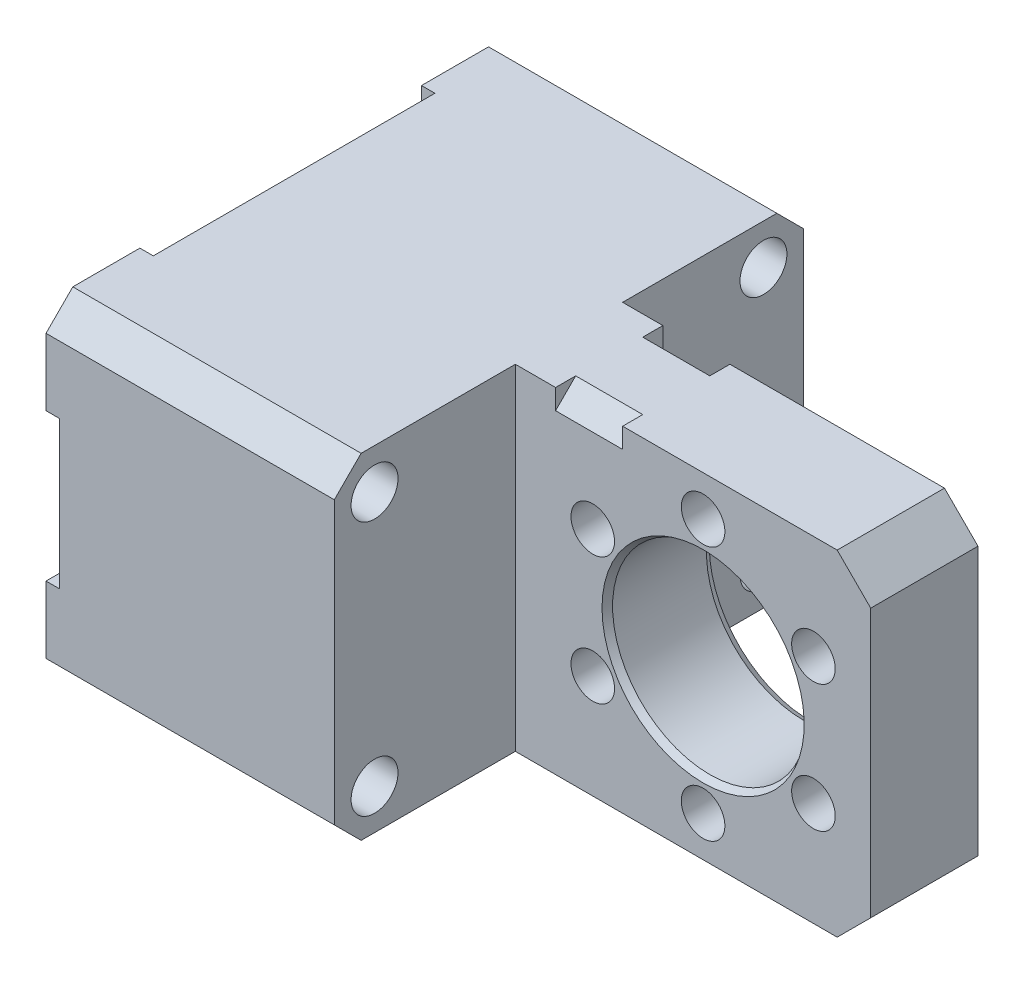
from build123d import *

# Parameters (mm, degrees)
BOSS_EXTRU_1_DEPTH            = 25
DIAM_TRE_DU_PER_AGE_7_0_7_1_D = 7
ESQUISSE4_R                   = 14.5
ENL_V_MAT_EXTRU_1_DEPTH       = 30
ESQUISSE5_R                   = 3.25
ENL_V_MAT_EXTRU_2_DEPTH       = 30
R_P_TITION_CIRCULAIRE1_COUNT  = 6
CHANFREIN1_SIZE               = 4
CHANFREIN2_SIZE               = 5
ESQUISSE6_OUTSIDE_W           = 97.78
ESQUISSE6_OUTSIDE_H           = 77.78
ENL_V_MAT_EXTRU_3_DEPTH       = 2
ENL_V_START                   = 6
ENL_V_MAT_EXTRU_4_DEPTH       = 10
CHANFREIN3_SIZE               = 1
CHANFREIN3_SIZE2              = 0.577350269


with BuildPart() as part:
    # Esquisse1 → Boss.-Extru.1 (new, symmetric)
    with BuildSketch(Plane(origin=(0, 0, 0), x_dir=(1, 0, 0), z_dir=(0, 1, 0))):
        Polygon((0, 0), (43, 0), (43, -27), (96, -27), (96, -43), (43, -43), (43, -70), (0, -70), align=None)
    extrude(amount=BOSS_EXTRU_1_DEPTH, both=True)

    # Diam_tre du per_age _7.0 _7_1 (through all)
    with Locations(Plane(origin=(43, 0, 0), x_dir=(0, 0, -1), z_dir=(1, 0, 0))):
        with Locations((-64, 19), (-6, 19), (-6, -19), (-64, -19)):
            Hole(DIAM_TRE_DU_PER_AGE_7_0_7_1_D / 2)

    # Esquisse4 → Enl_v. mat.-Extru.1 (cut)
    with BuildSketch(Plane(origin=(0, 0, 27), x_dir=(-1, 0, 0), z_dir=(0, 0, -1))):
        with Locations((-71, 0)):
            Circle(ESQUISSE4_R)
    extrude(amount=-ENL_V_MAT_EXTRU_1_DEPTH, mode=Mode.SUBTRACT)

    # Esquisse5 → Enl_v. mat.-Extru.2 (cut)
    with BuildSketch(Plane(origin=(0, 0, 27), x_dir=(-1, 0, 0), z_dir=(0, 0, -1))):
        with Locations((-71, -19)):
            Circle(ESQUISSE5_R)
    enl_v_mat_extru_2 = extrude(amount=-ENL_V_MAT_EXTRU_2_DEPTH, mode=Mode.SUBTRACT)

    # R_p_tition circulaire1: Enl_v. mat.-Extru.2 ×6 about axis
    r_p_tition_circulaire1_axis = Axis((71, 0, 0), (0, 0, 1))
    for i in range(1, R_P_TITION_CIRCULAIRE1_COUNT):
        add(enl_v_mat_extru_2.rotate(r_p_tition_circulaire1_axis, i * 360 / R_P_TITION_CIRCULAIRE1_COUNT), mode=Mode.SUBTRACT)

    # Chanfrein1
    chanfrein1_edges = [part.edges().sort_by_distance(p)[0] for p in [
        (21.5, -25, 70),
        (21.5, 25, 0),
        (21.5, 25, 70),
        (21.5, -25, 0),
    ]]
    chamfer(chanfrein1_edges, length=CHANFREIN1_SIZE)

    # Chanfrein2
    chanfrein2_edges = [part.edges().sort_by_distance(p)[0] for p in [
        (96, 25, 35),
        (96, -25, 35),
    ]]
    chamfer(chanfrein2_edges, length=CHANFREIN2_SIZE)

    # Esquisse6 outside → Enl_v. mat.-Extru.3 (cut)
    with BuildSketch(Plane.ZY):
        with Locations((35, 0)):
            Rectangle(ESQUISSE6_OUTSIDE_W, ESQUISSE6_OUTSIDE_H)
        with BuildLine():
            Line((56, 25), (70, 25))
            Line((70, 25), (70, 11))
            Line((70, 11), (64, 11))
            ThreePointArc((64, 11), (58.343145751, 13.343145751), (56, 19))
            Line((56, 19), (56, 25))
        make_face(mode=Mode.SUBTRACT)
        with BuildLine():
            Line((0, 25), (14, 25))
            Line((14, 25), (14, 19))
            ThreePointArc((14, 19), (11.656854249, 13.343145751), (6, 11))
            Line((6, 11), (0, 11))
            Line((0, 11), (0, 25))
        make_face(mode=Mode.SUBTRACT)
        with BuildLine():
            Line((0, -11), (6, -11))
            ThreePointArc((6, -11), (11.656854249, -13.343145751), (14, -19))
            Line((14, -19), (14, -25))
            Line((14, -25), (0, -25))
            Line((0, -25), (0, -11))
        make_face(mode=Mode.SUBTRACT)
        with BuildLine():
            Line((64, -11), (70, -11))
            Line((70, -11), (70, -25))
            Line((70, -25), (56, -25))
            Line((56, -25), (56, -19))
            ThreePointArc((56, -19), (58.343145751, -13.343145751), (64, -11))
        make_face(mode=Mode.SUBTRACT)
    extrude(amount=-ENL_V_MAT_EXTRU_3_DEPTH, mode=Mode.SUBTRACT)

    # Esquisse7 → Enl_v. mat.-Extru.4 (cut)
    with BuildSketch(Plane(origin=(43, 0, 0), x_dir=(0, 0, -1), z_dir=(1, 0, 0)).offset(ENL_V_START)):
        Polygon((-43, 22), (-43, 25), (-40, 25), align=None)
        Polygon((-30, 25), (-27, 25), (-27, 22), align=None)
    extrude(amount=ENL_V_MAT_EXTRU_4_DEPTH, mode=Mode.SUBTRACT)

    # Chanfrein3
    chanfrein3_edges = [part.edges().sort_by_distance(p)[0] for p in [
        (85.5, 0, 43),
        (85.5, 0, 27),
    ]]
    chanfrein3_side = [part.faces().sort_by_distance(p)[0] for p in [
        (85.5, 0, 35),
    ]]
    chamfer(chanfrein3_edges, length=CHANFREIN3_SIZE, length2=CHANFREIN3_SIZE2, reference=chanfrein3_side[0])


solid = part.part
